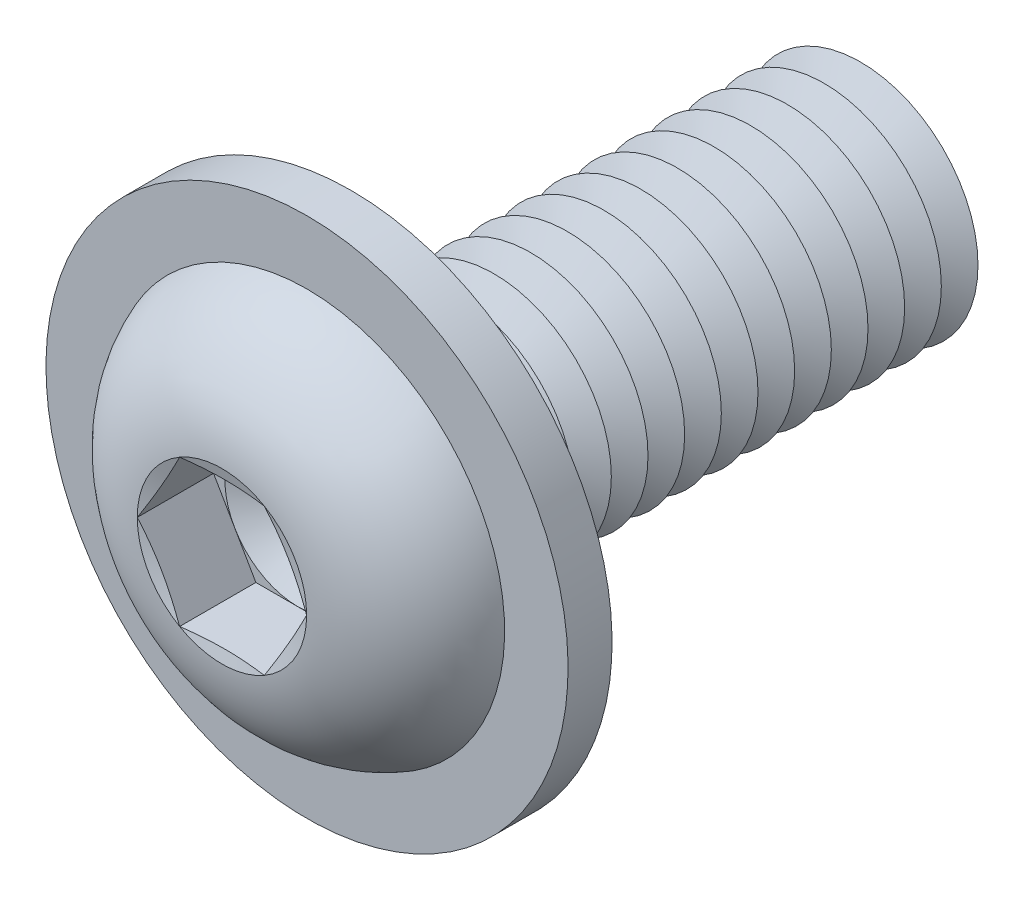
from build123d import *

# Parameters (mm, degrees)
FILLET1_R           = 0.625
LPATTERN1_COUNT     = 14
LPATTERN1_PITCH     = 1.25
CUT_EXTRUDE1_DEPTH  = 2.6
SKETCH5_R           = 8.9
SKETCH5_R_2         = 4.625
BOSS_EXTRUDE1_DEPTH = 1.5


with BuildPart() as part:
    # Sketch1 → Revolve1 (revolve)
    with BuildSketch(Plane(origin=(0, 0, 0), x_dir=(0, 0, -1), z_dir=(1, 0, 0)), mode=Mode.PRIVATE) as revolve1_sk:
        with BuildLine():
            Line((0, 4), (0, 7))
            ThreePointArc((0, 7), (-3.011595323, 5.81154966), (-4.4, 2.88675))
            Line((-4.4, 2.88675), (-4.013248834, 1.443375))
            Line((-4.013248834, 1.443375), (-4.4, 1.443375))
            Line((-4.4, 1.443375), (-4.4, 0))
            Line((-4.4, 0), (18, 0))
            Line((18, 0), (18, 4))
            Line((18, 4), (0, 4))
        make_face()
    revolve(revolve1_sk.sketch.rotate(Axis((0, 0, -18), (0, 0, 1)), 90), axis=Axis((0, 0, -18), (0, 0, 1)))

    # Fillet1
    fillet1_edges = [part.edges().sort_by_distance(p)[0] for p in [
        (4, 0, 0),
    ]]
    fillet(fillet1_edges, radius=FILLET1_R)

    # Sketch2 → Cut-Revolve1 (revolve, cut)
    with BuildSketch(Plane(origin=(0, 0, 0), x_dir=(0, 0, -1), z_dir=(1, 0, 0)), mode=Mode.PRIVATE) as cut_revolve1_sk:
        Polygon((17.375, 4), (18.625, 4), (18, 2.917468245), align=None)
    cut_revolve1 = revolve(cut_revolve1_sk.sketch.rotate(Axis((0, 0, -18), (0, 0, -1)), 270), axis=Axis((0, 0, -18), (0, 0, -1)), mode=Mode.SUBTRACT)

    # LPattern1: Cut-Revolve1 ×14
    with Locations(*[(0, 0, i * LPATTERN1_PITCH) for i in range(1, LPATTERN1_COUNT)]):
        add(cut_revolve1, mode=Mode.SUBTRACT)

    # Sketch3 → Cut-Extrude1 (cut)
    with BuildSketch(Plane.XY.offset(4.4)):
        Polygon((1.443375, 2.499998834), (-1.443375, 2.499998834), (-2.88675, 0), (-1.443375, -2.499998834), (1.443375, -2.499998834), (2.88675, 0), align=None)
    extrude(amount=-CUT_EXTRUDE1_DEPTH, mode=Mode.SUBTRACT)

    # Cut-Extrude2 cone 1 section (on through the dimple's axis) → Cut-Extrude2 (revolve, cut)
    with BuildSketch(Plane(origin=(0, 0, 1.8), x_dir=(0, -1, 0), z_dir=(1, 0, 0))):
        Polygon((0, 0), (2.499998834, 0), (0, 1.443375), align=None)
    revolve(axis=Axis((0, 0, 1.8), (0, 0, -1)), mode=Mode.SUBTRACT)

    # Sketch5 → Boss-Extrude1 (add)
    with BuildSketch(Plane(origin=(0, 0, 0), x_dir=(-1, 0, 0), z_dir=(0, 0, -1))):
        with Locations(Location((0, 0, 0), (0, 0, 90))):
            Circle(SKETCH5_R)
        Circle(SKETCH5_R_2, mode=Mode.SUBTRACT)
    extrude(amount=-BOSS_EXTRUDE1_DEPTH)


solid = part.part
